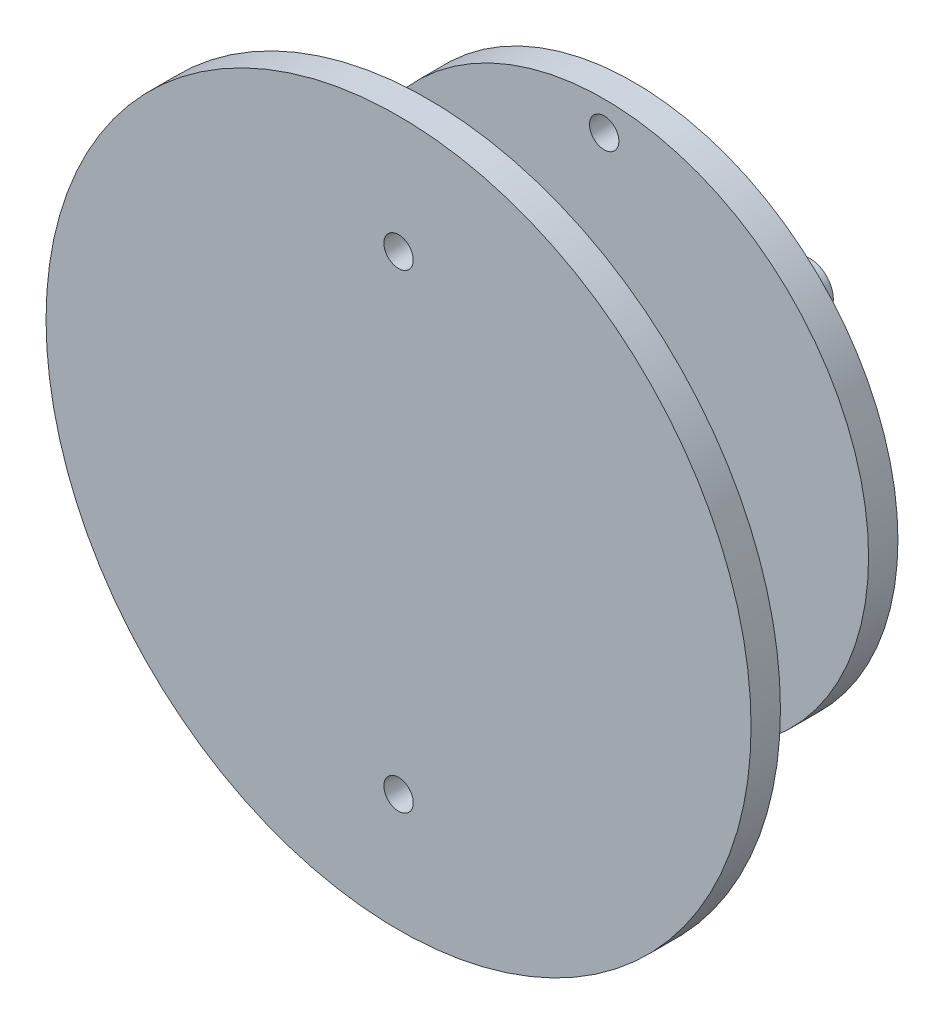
from build123d import *

# Parameters (mm, degrees)
SKETCH_1_R          = 4
EXTRUDE_1_DEPTH     = 70
SKETCH_2_R          = 60
EXTRUDE_2_DEPTH     = 5
EXTRUDE_START       = -30
SKETCH_5_R          = 45
EXTRUDE_3_DEPTH     = 5
SKETCH_6_R          = 2.5
CUT_EXTRUDE_1_DEPTH = 100


with BuildPart() as part:
    # Sketch 1 → Extrude 1 (new body)
    with BuildSketch(Plane.XY):
        Circle(SKETCH_1_R)
    extrude(amount=EXTRUDE_1_DEPTH)

    # Sketch 2 → Extrude 2 (add)
    with BuildSketch(Plane.XY.offset(70)):
        Circle(SKETCH_2_R)
    extrude(amount=-EXTRUDE_2_DEPTH)

    # Sketch 5 → Extrude 3 (add)
    with BuildSketch(Plane(origin=(0, 0, 0), x_dir=(-1, 0, 0), z_dir=(0, 0, -1)).offset(EXTRUDE_START)):
        Circle(SKETCH_5_R)
    extrude(amount=-EXTRUDE_3_DEPTH)

    # Sketch 6 → Cut-Extrude 1 (cut)
    with BuildSketch(Plane(origin=(0, 0, 30), x_dir=(-1, 0, 0), z_dir=(0, 0, -1))):
        with Locations((0, 40)):
            Circle(SKETCH_6_R)
    cut_extrude_1 = extrude(amount=-CUT_EXTRUDE_1_DEPTH, mode=Mode.SUBTRACT)

    # Mirror 1: Cut-Extrude 1 across plane
    add(cut_extrude_1.mirror(Plane.ZX), mode=Mode.SUBTRACT)


solid = part.part
